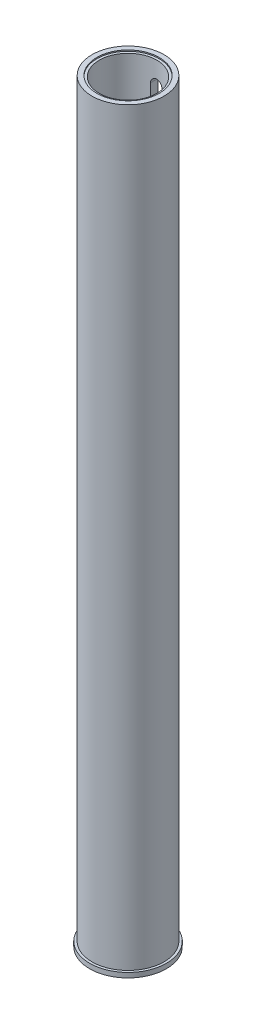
ISO-10303-21;
HEADER;
FILE_DESCRIPTION(('STEP AP214'),'2;1');
FILE_NAME('part.step','',(''),(''),'','','');
FILE_SCHEMA(('AUTOMOTIVE_DESIGN { 1 0 10303 214 1 1 1 1 }'));
ENDSEC;
DATA;
#1=APPLICATION_CONTEXT('core data for automotive mechanical design processes');
#2=APPLICATION_PROTOCOL_DEFINITION('international standard','automotive_design',2000,#1);
#3=PRODUCT_CONTEXT('',#1,'mechanical');
#4=PRODUCT('Part','Part','',(#3));
#5=PRODUCT_RELATED_PRODUCT_CATEGORY('part','',(#4));
#6=PRODUCT_DEFINITION_FORMATION('','',#4);
#7=PRODUCT_DEFINITION_CONTEXT('part definition',#1,'design');
#8=PRODUCT_DEFINITION('design','',#6,#7);
#9=PRODUCT_DEFINITION_SHAPE('','',#8);
#10=(LENGTH_UNIT() NAMED_UNIT(*) SI_UNIT(.MILLI.,.METRE.));
#11=(NAMED_UNIT(*) PLANE_ANGLE_UNIT() SI_UNIT($,.RADIAN.));
#12=(NAMED_UNIT(*) SI_UNIT($,.STERADIAN.) SOLID_ANGLE_UNIT());
#13=UNCERTAINTY_MEASURE_WITH_UNIT(LENGTH_MEASURE(1.E-05),#10,'distance_accuracy_value','');
#14=(GEOMETRIC_REPRESENTATION_CONTEXT(3) GLOBAL_UNCERTAINTY_ASSIGNED_CONTEXT((#13)) GLOBAL_UNIT_ASSIGNED_CONTEXT((#10,
#11,#12)) REPRESENTATION_CONTEXT('',''));
#15=CARTESIAN_POINT('',(0.,0.,0.));
#16=DIRECTION('',(0.,0.,1.));
#17=DIRECTION('',(1.,0.,0.));
#18=AXIS2_PLACEMENT_3D('',#15,#16,#17);
#19=CARTESIAN_POINT('',(0.,496.0874,0.));
#20=DIRECTION('',(0.,-1.,0.));
#21=DIRECTION('',(0.,0.,-1.));
#22=AXIS2_PLACEMENT_3D('',#19,#20,#21);
#23=CYLINDRICAL_SURFACE('',#22,23.8125);
#24=DIRECTION('',(0.,-1.,0.));
#25=VECTOR('',#24,1.);
#26=CARTESIAN_POINT('',(3.80999999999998,496.0874,-23.5057239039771));
#27=LINE('',#26,#25);
#28=CARTESIAN_POINT('',(3.80999999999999,480.5934,-23.5057239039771));
#29=VERTEX_POINT('',#28);
#30=CARTESIAN_POINT('',(3.81000000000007,290.83,-23.5057239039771));
#31=VERTEX_POINT('',#30);
#32=EDGE_CURVE('E132',#29,#31,#27,.T.);
#33=ORIENTED_EDGE('',*,*,#32,.F.);
#34=CARTESIAN_POINT('',(-3.80999999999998,480.5934,-23.5057239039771));
#35=CARTESIAN_POINT('',(-3.81001106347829,480.699828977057,-23.5057166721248));
#36=CARTESIAN_POINT('',(-3.80554059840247,480.806252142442,-23.5064465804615));
#37=CARTESIAN_POINT('',(-3.78772235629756,481.018323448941,-23.5093271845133));
#38=CARTESIAN_POINT('',(-3.77437543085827,481.123971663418,-23.5114777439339));
#39=CARTESIAN_POINT('',(-3.73891174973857,481.333621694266,-23.5171426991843));
#40=CARTESIAN_POINT('',(-3.71680577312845,481.437625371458,-23.5206554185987));
#41=CARTESIAN_POINT('',(-3.66401383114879,481.643350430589,-23.5289367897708));
#42=CARTESIAN_POINT('',(-3.63332788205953,481.745071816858,-23.5337054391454));
#43=CARTESIAN_POINT('',(-3.52868455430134,482.045788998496,-23.5497048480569));
#44=CARTESIAN_POINT('',(-3.4421182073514,482.240475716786,-23.5626330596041));
#45=CARTESIAN_POINT('',(-3.23799240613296,482.612456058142,-23.5915475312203));
#46=CARTESIAN_POINT('',(-3.12043305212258,482.78974973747,-23.6075337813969));
#47=CARTESIAN_POINT('',(-2.85650155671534,483.123640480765,-23.6409252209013));
#48=CARTESIAN_POINT('',(-2.70990569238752,483.28005997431,-23.6583407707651));
#49=CARTESIAN_POINT('',(-2.39253784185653,483.566198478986,-23.6925377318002));
#50=CARTESIAN_POINT('',(-2.22176216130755,483.695913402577,-23.7093190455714));
#51=CARTESIAN_POINT('',(-1.85973197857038,483.925621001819,-23.7404652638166));
#52=CARTESIAN_POINT('',(-1.66837059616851,484.025447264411,-23.754816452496));
#53=CARTESIAN_POINT('',(-1.27133941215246,484.191466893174,-23.7793684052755));
#54=CARTESIAN_POINT('',(-1.06567129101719,484.257664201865,-23.7895696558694));
#55=CARTESIAN_POINT('',(-0.647710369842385,484.354007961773,-23.8045996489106));
#56=CARTESIAN_POINT('',(-0.435488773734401,484.384456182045,-23.8094733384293));
#57=CARTESIAN_POINT('',(-0.00889157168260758,484.409375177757,-23.8134533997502));
#58=CARTESIAN_POINT('',(0.205483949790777,484.403847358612,-23.8125599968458));
#59=CARTESIAN_POINT('',(0.628231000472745,484.35720660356,-23.805142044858));
#60=CARTESIAN_POINT('',(0.836639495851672,484.316419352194,-23.7986690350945));
#61=CARTESIAN_POINT('',(1.24361452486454,484.200929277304,-23.780876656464));
#62=CARTESIAN_POINT('',(1.44218083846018,484.126225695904,-23.7695571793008));
#63=CARTESIAN_POINT('',(1.82481432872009,483.944696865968,-23.743255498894));
#64=CARTESIAN_POINT('',(2.00881588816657,483.837735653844,-23.7282578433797));
#65=CARTESIAN_POINT('',(2.3563771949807,483.594822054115,-23.6962686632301));
#66=CARTESIAN_POINT('',(2.5199361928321,483.458868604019,-23.6792770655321));
#67=CARTESIAN_POINT('',(2.82386592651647,483.160075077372,-23.6449705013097));
#68=CARTESIAN_POINT('',(2.96396011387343,482.996954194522,-23.6276540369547));
#69=CARTESIAN_POINT('',(3.21491020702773,482.649213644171,-23.5948214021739));
#70=CARTESIAN_POINT('',(3.32575772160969,482.464587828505,-23.5793057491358));
#71=CARTESIAN_POINT('',(3.46764419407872,482.17553491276,-23.5587110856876));
#72=CARTESIAN_POINT('',(3.51091641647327,482.077027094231,-23.5522859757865));
#73=CARTESIAN_POINT('',(3.58899422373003,481.876660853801,-23.5405148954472));
#74=CARTESIAN_POINT('',(3.62380307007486,481.774803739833,-23.5351685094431));
#75=CARTESIAN_POINT('',(3.68465561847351,481.568574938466,-23.5257181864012));
#76=CARTESIAN_POINT('',(3.71070857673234,481.464206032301,-23.5216129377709));
#77=CARTESIAN_POINT('',(3.75389522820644,481.253636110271,-23.514759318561));
#78=CARTESIAN_POINT('',(3.77103320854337,481.147436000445,-23.5120102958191));
#79=CARTESIAN_POINT('',(3.79243150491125,480.966439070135,-23.5085664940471));
#80=CARTESIAN_POINT('',(3.7990232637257,480.891916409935,-23.5075012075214));
#81=CARTESIAN_POINT('',(3.80780473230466,480.742731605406,-23.5060797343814));
#82=CARTESIAN_POINT('',(3.81000184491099,480.668069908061,-23.5057223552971));
#83=CARTESIAN_POINT('',(3.80999999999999,480.5934,-23.5057239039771));
#84=B_SPLINE_CURVE_WITH_KNOTS('',3,(#34,#35,#36,#37,#38,#39,#40,#41,#42,#43,#44,#45,#46,#47,#48,
#49,#50,#51,#52,#53,#54,#55,#56,#57,#58,#59,#60,#61,#62,#63,#64,#65,#66,#67,#68,#69,#70,#71,#72,
#73,#74,#75,#76,#77,#78,#79,#80,#81,#82,#83),.UNSPECIFIED.,.F.,.F.,(4,2,2,2,2,2,2,2,2,2,2,2,2,2,
2,2,2,2,2,2,2,2,2,2,4),(0.,0.319180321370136,0.638330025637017,0.957088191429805,
1.27584575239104,1.91294632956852,2.55004484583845,3.19225776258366,3.83456890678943,
4.48039248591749,5.12614033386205,5.7663971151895,6.40662888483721,7.04100938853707,
7.67540406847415,8.31251096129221,8.94964120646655,9.59381999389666,10.2381834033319,
10.5612174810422,10.8841268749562,11.2066938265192,11.5291055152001,11.7534440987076,
11.9774044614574),.UNSPECIFIED.);
#85=CARTESIAN_POINT('',(-3.80999999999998,480.5934,-23.5057239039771));
#86=VERTEX_POINT('',#85);
#87=EDGE_CURVE('E126',#86,#29,#84,.T.);
#88=ORIENTED_EDGE('',*,*,#87,.F.);
#89=DIRECTION('',(0.,-1.,0.));
#90=VECTOR('',#89,1.);
#91=CARTESIAN_POINT('',(-3.80999999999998,496.0874,-23.5057239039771));
#92=LINE('',#91,#90);
#93=CARTESIAN_POINT('',(-3.80999999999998,290.83,-23.5057239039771));
#94=VERTEX_POINT('',#93);
#95=EDGE_CURVE('E86',#94,#86,#92,.F.);
#96=ORIENTED_EDGE('',*,*,#95,.F.);
#97=CARTESIAN_POINT('',(3.81000000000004,290.83,-23.5057239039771));
#98=CARTESIAN_POINT('',(3.81001106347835,290.723571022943,-23.5057166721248));
#99=CARTESIAN_POINT('',(3.80554059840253,290.617147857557,-23.5064465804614));
#100=CARTESIAN_POINT('',(3.78772235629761,290.405076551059,-23.5093271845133));
#101=CARTESIAN_POINT('',(3.77437543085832,290.299428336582,-23.5114777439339));
#102=CARTESIAN_POINT('',(3.73891174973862,290.089778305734,-23.5171426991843));
#103=CARTESIAN_POINT('',(3.7168057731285,289.985774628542,-23.5206554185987));
#104=CARTESIAN_POINT('',(3.66401383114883,289.780049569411,-23.5289367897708));
#105=CARTESIAN_POINT('',(3.63332788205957,289.678328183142,-23.5337054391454));
#106=CARTESIAN_POINT('',(3.52868455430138,289.377611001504,-23.5497048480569));
#107=CARTESIAN_POINT('',(3.44211820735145,289.182924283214,-23.5626330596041));
#108=CARTESIAN_POINT('',(3.23799240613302,288.810943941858,-23.5915475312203));
#109=CARTESIAN_POINT('',(3.12043305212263,288.63365026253,-23.6075337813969));
#110=CARTESIAN_POINT('',(2.85650155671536,288.299759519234,-23.6409252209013));
#111=CARTESIAN_POINT('',(2.70990569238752,288.143340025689,-23.6583407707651));
#112=CARTESIAN_POINT('',(2.39253784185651,287.857201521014,-23.6925377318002));
#113=CARTESIAN_POINT('',(2.22176216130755,287.727486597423,-23.7093190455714));
#114=CARTESIAN_POINT('',(1.85973197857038,287.497778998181,-23.7404652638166));
#115=CARTESIAN_POINT('',(1.66837059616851,287.397952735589,-23.754816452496));
#116=CARTESIAN_POINT('',(1.27133941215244,287.231933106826,-23.7793684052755));
#117=CARTESIAN_POINT('',(1.06567129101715,287.165735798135,-23.7895696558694));
#118=CARTESIAN_POINT('',(0.64771036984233,287.069392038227,-23.8045996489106));
#119=CARTESIAN_POINT('',(0.435488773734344,287.038943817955,-23.8094733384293));
#120=CARTESIAN_POINT('',(0.00889157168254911,287.014024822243,-23.8134533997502));
#121=CARTESIAN_POINT('',(-0.205483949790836,287.019552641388,-23.8125599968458));
#122=CARTESIAN_POINT('',(-0.628231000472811,287.06619339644,-23.805142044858));
#123=CARTESIAN_POINT('',(-0.836639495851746,287.106980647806,-23.7986690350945));
#124=CARTESIAN_POINT('',(-1.24361452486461,287.222470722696,-23.780876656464));
#125=CARTESIAN_POINT('',(-1.44218083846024,287.297174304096,-23.7695571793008));
#126=CARTESIAN_POINT('',(-1.82481432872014,287.478703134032,-23.743255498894));
#127=CARTESIAN_POINT('',(-2.00881588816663,287.585664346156,-23.7282578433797));
#128=CARTESIAN_POINT('',(-2.35637719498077,287.828577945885,-23.6962686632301));
#129=CARTESIAN_POINT('',(-2.51993619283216,287.964531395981,-23.6792770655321));
#130=CARTESIAN_POINT('',(-2.82386592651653,288.263324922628,-23.6449705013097));
#131=CARTESIAN_POINT('',(-2.9639601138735,288.426445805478,-23.6276540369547));
#132=CARTESIAN_POINT('',(-3.2149102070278,288.774186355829,-23.5948214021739));
#133=CARTESIAN_POINT('',(-3.32575772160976,288.958812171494,-23.5793057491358));
#134=CARTESIAN_POINT('',(-3.4676441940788,289.24786508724,-23.5587110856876));
#135=CARTESIAN_POINT('',(-3.51091641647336,289.346372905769,-23.5522859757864));
#136=CARTESIAN_POINT('',(-3.58899422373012,289.546739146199,-23.5405148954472));
#137=CARTESIAN_POINT('',(-3.62380307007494,289.648596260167,-23.5351685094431));
#138=CARTESIAN_POINT('',(-3.68465561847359,289.854825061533,-23.5257181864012));
#139=CARTESIAN_POINT('',(-3.71070857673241,289.959193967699,-23.5216129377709));
#140=CARTESIAN_POINT('',(-3.7538952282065,290.169763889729,-23.514759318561));
#141=CARTESIAN_POINT('',(-3.77103320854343,290.275963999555,-23.5120102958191));
#142=CARTESIAN_POINT('',(-3.7924315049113,290.456960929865,-23.5085664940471));
#143=CARTESIAN_POINT('',(-3.79902326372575,290.531483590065,-23.5075012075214));
#144=CARTESIAN_POINT('',(-3.8078047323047,290.680668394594,-23.5060797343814));
#145=CARTESIAN_POINT('',(-3.81000184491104,290.755330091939,-23.5057223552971));
#146=CARTESIAN_POINT('',(-3.81000000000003,290.83,-23.5057239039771));
#147=B_SPLINE_CURVE_WITH_KNOTS('',3,(#97,#98,#99,#100,#101,#102,#103,#104,#105,#106,#107,#108,
#109,#110,#111,#112,#113,#114,#115,#116,#117,#118,#119,#120,#121,#122,#123,#124,#125,#126,#127,
#128,#129,#130,#131,#132,#133,#134,#135,#136,#137,#138,#139,#140,#141,#142,#143,#144,#145,#146),
.UNSPECIFIED.,.F.,.F.,(4,2,2,2,2,2,2,2,2,2,2,2,2,2,2,2,2,2,2,2,2,2,2,2,4),(0.,0.319180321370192,
0.638330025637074,0.957088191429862,1.2758457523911,1.91294632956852,2.55004484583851,
3.19225776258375,3.83456890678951,4.48039248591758,5.12614033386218,5.76639711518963,
6.40662888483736,7.04100938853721,7.6754040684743,8.31251096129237,8.94964120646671,
9.59381999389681,10.2381834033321,10.5612174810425,10.8841268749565,11.2066938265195,
11.5291055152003,11.7534440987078,11.9774044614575),.UNSPECIFIED.);
#148=EDGE_CURVE('E46',#31,#94,#147,.T.);
#149=ORIENTED_EDGE('',*,*,#148,.F.);
#150=EDGE_LOOP('',(#33,#88,#96,#149));
#151=FACE_BOUND('',#150,.T.);
#152=CARTESIAN_POINT('',(0.,496.0874,0.));
#153=DIRECTION('',(0.,1.,0.));
#154=DIRECTION('',(0.,0.,1.));
#155=AXIS2_PLACEMENT_3D('',#152,#153,#154);
#156=CIRCLE('',#155,23.8125);
#157=CARTESIAN_POINT('',(0.,496.0874,23.8125));
#158=VERTEX_POINT('',#157);
#159=EDGE_CURVE('E153',#158,#158,#156,.T.);
#160=ORIENTED_EDGE('',*,*,#159,.F.);
#161=EDGE_LOOP('',(#160));
#162=FACE_BOUND('',#161,.T.);
#163=CARTESIAN_POINT('',(0.,0.,0.));
#164=DIRECTION('',(0.,1.,0.));
#165=DIRECTION('',(0.,0.,1.));
#166=AXIS2_PLACEMENT_3D('',#163,#164,#165);
#167=CIRCLE('',#166,23.8125);
#168=CARTESIAN_POINT('',(0.,0.,23.8125));
#169=VERTEX_POINT('',#168);
#170=EDGE_CURVE('E146',#169,#169,#167,.T.);
#171=ORIENTED_EDGE('',*,*,#170,.T.);
#172=EDGE_LOOP('',(#171));
#173=FACE_BOUND('',#172,.T.);
#174=ADVANCED_FACE('F32',(#151,#162,#173),#23,.T.);
#175=CARTESIAN_POINT('',(0.,496.0874,0.));
#176=DIRECTION('',(0.,1.,0.));
#177=DIRECTION('',(0.,0.,1.));
#178=AXIS2_PLACEMENT_3D('',#175,#176,#177);
#179=PLANE('',#178);
#180=CARTESIAN_POINT('',(0.,496.0874,0.));
#181=DIRECTION('',(0.,1.,0.));
#182=DIRECTION('',(0.,0.,1.));
#183=AXIS2_PLACEMENT_3D('',#180,#181,#182);
#184=CIRCLE('',#183,20.6375);
#185=CARTESIAN_POINT('',(0.,496.0874,20.6375));
#186=VERTEX_POINT('',#185);
#187=EDGE_CURVE('E147',#186,#186,#184,.T.);
#188=ORIENTED_EDGE('',*,*,#187,.F.);
#189=EDGE_LOOP('',(#188));
#190=FACE_BOUND('',#189,.T.);
#191=ORIENTED_EDGE('',*,*,#159,.T.);
#192=EDGE_LOOP('',(#191));
#193=FACE_BOUND('',#192,.T.);
#194=ADVANCED_FACE('F169',(#190,#193),#179,.T.);
#195=CARTESIAN_POINT('',(0.,495.3,0.));
#196=DIRECTION('',(0.,1.,0.));
#197=DIRECTION('',(0.,0.,1.));
#198=AXIS2_PLACEMENT_3D('',#195,#196,#197);
#199=CYLINDRICAL_SURFACE('',#198,20.6375);
#200=CARTESIAN_POINT('',(0.,495.3,0.));
#201=DIRECTION('',(0.,1.,0.));
#202=DIRECTION('',(0.,0.,1.));
#203=AXIS2_PLACEMENT_3D('',#200,#201,#202);
#204=CIRCLE('',#203,20.6375);
#205=CARTESIAN_POINT('',(0.,495.3,20.6375));
#206=VERTEX_POINT('',#205);
#207=EDGE_CURVE('E150',#206,#206,#204,.T.);
#208=ORIENTED_EDGE('',*,*,#207,.F.);
#209=EDGE_LOOP('',(#208));
#210=FACE_BOUND('',#209,.T.);
#211=ORIENTED_EDGE('',*,*,#187,.T.);
#212=EDGE_LOOP('',(#211));
#213=FACE_BOUND('',#212,.T.);
#214=ADVANCED_FACE('F174',(#210,#213),#199,.F.);
#215=CARTESIAN_POINT('',(0.,495.3,0.));
#216=DIRECTION('',(0.,1.,0.));
#217=DIRECTION('',(0.,0.,1.));
#218=AXIS2_PLACEMENT_3D('',#215,#216,#217);
#219=PLANE('',#218);
#220=CARTESIAN_POINT('',(0.,495.3,0.));
#221=DIRECTION('',(0.,1.,0.));
#222=DIRECTION('',(0.,0.,1.));
#223=AXIS2_PLACEMENT_3D('',#220,#221,#222);
#224=CIRCLE('',#223,19.05);
#225=CARTESIAN_POINT('',(0.,495.3,19.05));
#226=VERTEX_POINT('',#225);
#227=EDGE_CURVE('E137',#226,#226,#224,.T.);
#228=ORIENTED_EDGE('',*,*,#227,.F.);
#229=EDGE_LOOP('',(#228));
#230=FACE_BOUND('',#229,.T.);
#231=ORIENTED_EDGE('',*,*,#207,.T.);
#232=EDGE_LOOP('',(#231));
#233=FACE_BOUND('',#232,.T.);
#234=ADVANCED_FACE('F192',(#230,#233),#219,.T.);
#235=CARTESIAN_POINT('',(0.,-3.175,0.));
#236=DIRECTION('',(0.,1.,0.));
#237=DIRECTION('',(0.,0.,1.));
#238=AXIS2_PLACEMENT_3D('',#235,#236,#237);
#239=CYLINDRICAL_SURFACE('',#238,25.4);
#240=CARTESIAN_POINT('',(0.,-3.175,0.));
#241=DIRECTION('',(0.,-1.,0.));
#242=DIRECTION('',(0.,0.,-1.));
#243=AXIS2_PLACEMENT_3D('',#240,#241,#242);
#244=CIRCLE('',#243,25.4);
#245=CARTESIAN_POINT('',(0.,-3.175,-25.4));
#246=VERTEX_POINT('',#245);
#247=EDGE_CURVE('E143',#246,#246,#244,.T.);
#248=ORIENTED_EDGE('',*,*,#247,.F.);
#249=EDGE_LOOP('',(#248));
#250=FACE_BOUND('',#249,.T.);
#251=CARTESIAN_POINT('',(0.,0.,0.));
#252=DIRECTION('',(0.,-1.,0.));
#253=DIRECTION('',(0.,0.,-1.));
#254=AXIS2_PLACEMENT_3D('',#251,#252,#253);
#255=CIRCLE('',#254,25.4);
#256=CARTESIAN_POINT('',(0.,0.,-25.4));
#257=VERTEX_POINT('',#256);
#258=EDGE_CURVE('E140',#257,#257,#255,.T.);
#259=ORIENTED_EDGE('',*,*,#258,.T.);
#260=EDGE_LOOP('',(#259));
#261=FACE_BOUND('',#260,.T.);
#262=ADVANCED_FACE('F190',(#250,#261),#239,.T.);
#263=CARTESIAN_POINT('',(0.,-3.175,0.));
#264=DIRECTION('',(0.,-1.,0.));
#265=DIRECTION('',(0.,0.,-1.));
#266=AXIS2_PLACEMENT_3D('',#263,#264,#265);
#267=PLANE('',#266);
#268=CARTESIAN_POINT('',(0.,-3.175,0.));
#269=DIRECTION('',(0.,-1.,0.));
#270=DIRECTION('',(0.,0.,-1.));
#271=AXIS2_PLACEMENT_3D('',#268,#269,#270);
#272=CIRCLE('',#271,20.4216);
#273=CARTESIAN_POINT('',(0.,-3.175,-20.4216));
#274=VERTEX_POINT('',#273);
#275=EDGE_CURVE('E11',#274,#274,#272,.F.);
#276=ORIENTED_EDGE('',*,*,#275,.T.);
#277=EDGE_LOOP('',(#276));
#278=FACE_BOUND('',#277,.T.);
#279=ORIENTED_EDGE('',*,*,#247,.T.);
#280=EDGE_LOOP('',(#279));
#281=FACE_BOUND('',#280,.T.);
#282=ADVANCED_FACE('F186',(#278,#281),#267,.T.);
#283=CARTESIAN_POINT('',(0.,0.,0.));
#284=DIRECTION('',(0.,-1.,0.));
#285=DIRECTION('',(0.,0.,-1.));
#286=AXIS2_PLACEMENT_3D('',#283,#284,#285);
#287=PLANE('',#286);
#288=ORIENTED_EDGE('',*,*,#170,.F.);
#289=EDGE_LOOP('',(#288));
#290=FACE_BOUND('',#289,.T.);
#291=ORIENTED_EDGE('',*,*,#258,.F.);
#292=EDGE_LOOP('',(#291));
#293=FACE_BOUND('',#292,.T.);
#294=ADVANCED_FACE('F166',(#290,#293),#287,.F.);
#295=CARTESIAN_POINT('',(0.,496.0874,0.));
#296=DIRECTION('',(0.,-1.,0.));
#297=DIRECTION('',(0.,0.,-1.));
#298=AXIS2_PLACEMENT_3D('',#295,#296,#297);
#299=CYLINDRICAL_SURFACE('',#298,19.05);
#300=DIRECTION('',(0.,-1.,0.));
#301=VECTOR('',#300,1.);
#302=CARTESIAN_POINT('',(-3.80999999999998,496.0874,-18.6651118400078));
#303=LINE('',#302,#301);
#304=CARTESIAN_POINT('',(-3.80999999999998,480.5934,-18.6651118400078));
#305=VERTEX_POINT('',#304);
#306=CARTESIAN_POINT('',(-3.80999999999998,290.83,-18.6651118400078));
#307=VERTEX_POINT('',#306);
#308=EDGE_CURVE('E83',#305,#307,#303,.T.);
#309=ORIENTED_EDGE('',*,*,#308,.F.);
#310=CARTESIAN_POINT('',(3.80999999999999,480.5934,-18.6651118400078));
#311=CARTESIAN_POINT('',(3.81001151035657,480.699415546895,-18.6651026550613));
#312=CARTESIAN_POINT('',(3.80557521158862,480.805424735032,-18.6660148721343));
#313=CARTESIAN_POINT('',(3.78789627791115,481.016663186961,-18.6696141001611));
#314=CARTESIAN_POINT('',(3.77465473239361,481.121892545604,-18.6723008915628));
#315=CARTESIAN_POINT('',(3.73948129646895,481.330671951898,-18.679375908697));
#316=CARTESIAN_POINT('',(3.7175626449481,481.434224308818,-18.6837615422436));
#317=CARTESIAN_POINT('',(3.66522916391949,481.639049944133,-18.6940980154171));
#318=CARTESIAN_POINT('',(3.63481429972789,481.740323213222,-18.7000488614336));
#319=CARTESIAN_POINT('',(3.53112740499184,482.039683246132,-18.7200071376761));
#320=CARTESIAN_POINT('',(3.44538500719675,482.233475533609,-18.7361263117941));
#321=CARTESIAN_POINT('',(3.24326967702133,482.603844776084,-18.7721647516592));
#322=CARTESIAN_POINT('',(3.12689356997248,482.780419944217,-18.7920844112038));
#323=CARTESIAN_POINT('',(2.86504804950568,483.113931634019,-18.8337928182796));
#324=CARTESIAN_POINT('',(2.71923153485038,483.27059359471,-18.8556019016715));
#325=CARTESIAN_POINT('',(2.40338773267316,483.55740945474,-18.8984544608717));
#326=CARTESIAN_POINT('',(2.23335670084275,483.687559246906,-18.9194978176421));
#327=CARTESIAN_POINT('',(1.87208197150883,483.918724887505,-18.958667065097));
#328=CARTESIAN_POINT('',(1.68066657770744,484.019477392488,-18.9767659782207));
#329=CARTESIAN_POINT('',(1.28321253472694,484.187281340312,-19.0077758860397));
#330=CARTESIAN_POINT('',(1.07717605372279,484.254337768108,-19.0206876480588));
#331=CARTESIAN_POINT('',(0.659196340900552,484.351991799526,-19.039725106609));
#332=CARTESIAN_POINT('',(0.447366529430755,484.383057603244,-19.0459378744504));
#333=CARTESIAN_POINT('',(0.0214117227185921,484.40930923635,-19.0511781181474));
#334=CARTESIAN_POINT('',(-0.192713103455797,484.404497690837,-19.0502061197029));
#335=CARTESIAN_POINT('',(-0.613951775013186,484.359485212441,-19.0412535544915));
#336=CARTESIAN_POINT('',(-0.821122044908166,484.319789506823,-19.0333730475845));
#337=CARTESIAN_POINT('',(-1.22579900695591,484.206936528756,-19.0116018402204));
#338=CARTESIAN_POINT('',(-1.42330538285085,484.133778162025,-18.9977109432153));
#339=CARTESIAN_POINT('',(-1.80449300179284,483.955609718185,-18.9653147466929));
#340=CARTESIAN_POINT('',(-1.98807895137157,483.850401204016,-18.9467808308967));
#341=CARTESIAN_POINT('',(-2.33517439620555,483.611259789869,-18.9071420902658));
#342=CARTESIAN_POINT('',(-2.49868222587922,483.477324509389,-18.8860370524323));
#343=CARTESIAN_POINT('',(-2.80395175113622,483.181813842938,-18.843156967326));
#344=CARTESIAN_POINT('',(-2.94528788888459,483.019800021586,-18.8213766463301));
#345=CARTESIAN_POINT('',(-3.19892993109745,482.673993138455,-18.7799343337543));
#346=CARTESIAN_POINT('',(-3.3112277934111,482.490194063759,-18.760272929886));
#347=CARTESIAN_POINT('',(-3.45546062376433,482.201982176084,-18.7340510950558));
#348=CARTESIAN_POINT('',(-3.4995629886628,482.103627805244,-18.7258431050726));
#349=CARTESIAN_POINT('',(-3.57930549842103,481.903459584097,-18.7107649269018));
#350=CARTESIAN_POINT('',(-3.61494894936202,481.801647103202,-18.7038942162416));
#351=CARTESIAN_POINT('',(-3.67745934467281,481.595397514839,-18.691704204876));
#352=CARTESIAN_POINT('',(-3.70433543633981,481.490963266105,-18.686383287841));
#353=CARTESIAN_POINT('',(-3.74914106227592,481.280162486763,-18.6774453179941));
#354=CARTESIAN_POINT('',(-3.76707485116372,481.173796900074,-18.6738274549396));
#355=CARTESIAN_POINT('',(-3.79030658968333,480.988299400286,-18.6691236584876));
#356=CARTESIAN_POINT('',(-3.79769503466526,480.909433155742,-18.6676205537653));
#357=CARTESIAN_POINT('',(-3.80753900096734,480.751513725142,-18.6656141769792));
#358=CARTESIAN_POINT('',(-3.81000277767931,480.672461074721,-18.665109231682));
#359=CARTESIAN_POINT('',(-3.80999999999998,480.5934,-18.6651118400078));
#360=B_SPLINE_CURVE_WITH_KNOTS('',3,(#310,#311,#312,#313,#314,#315,#316,#317,#318,#319,#320,
#321,#322,#323,#324,#325,#326,#327,#328,#329,#330,#331,#332,#333,#334,#335,#336,#337,#338,#339,
#340,#341,#342,#343,#344,#345,#346,#347,#348,#349,#350,#351,#352,#353,#354,#355,#356,#357,#358,
#359),.UNSPECIFIED.,.F.,.F.,(4,2,2,2,2,2,2,2,2,2,2,2,2,2,2,2,2,2,2,2,2,2,2,2,4),(0.,
0.317938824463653,0.635838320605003,0.953254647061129,1.27067226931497,1.90501053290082,
2.53941456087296,3.18178786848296,3.82426061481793,4.47232342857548,5.12029034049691,
5.75972972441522,6.39912232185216,7.02940444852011,7.65970718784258,8.29399458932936,
8.92833457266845,9.57365820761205,10.2191603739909,10.5431408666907,10.8669945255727,
11.1905092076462,11.5138698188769,11.7513950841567,11.9885218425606),.UNSPECIFIED.);
#361=CARTESIAN_POINT('',(3.80999999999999,480.5934,-18.6651118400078));
#362=VERTEX_POINT('',#361);
#363=EDGE_CURVE('E54',#362,#305,#360,.T.);
#364=ORIENTED_EDGE('',*,*,#363,.F.);
#365=DIRECTION('',(0.,-1.,0.));
#366=VECTOR('',#365,1.);
#367=CARTESIAN_POINT('',(3.80999999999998,496.0874,-18.6651118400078));
#368=LINE('',#367,#366);
#369=CARTESIAN_POINT('',(3.81000000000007,290.83,-18.6651118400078));
#370=VERTEX_POINT('',#369);
#371=EDGE_CURVE('E92',#370,#362,#368,.F.);
#372=ORIENTED_EDGE('',*,*,#371,.F.);
#373=CARTESIAN_POINT('',(-3.81000000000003,290.83,-18.6651118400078));
#374=CARTESIAN_POINT('',(-3.81001151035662,290.723984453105,-18.6651026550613));
#375=CARTESIAN_POINT('',(-3.80557521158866,290.617975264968,-18.6660148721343));
#376=CARTESIAN_POINT('',(-3.78789627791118,290.406736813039,-18.669614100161));
#377=CARTESIAN_POINT('',(-3.77465473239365,290.301507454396,-18.6723008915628));
#378=CARTESIAN_POINT('',(-3.73948129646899,290.092728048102,-18.679375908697));
#379=CARTESIAN_POINT('',(-3.71756264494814,289.989175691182,-18.6837615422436));
#380=CARTESIAN_POINT('',(-3.66522916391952,289.784350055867,-18.6940980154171));
#381=CARTESIAN_POINT('',(-3.63481429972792,289.683076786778,-18.7000488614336));
#382=CARTESIAN_POINT('',(-3.53112740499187,289.383716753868,-18.7200071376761));
#383=CARTESIAN_POINT('',(-3.44538500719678,289.189924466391,-18.7361263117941));
#384=CARTESIAN_POINT('',(-3.24326967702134,288.819555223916,-18.7721647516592));
#385=CARTESIAN_POINT('',(-3.12689356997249,288.642980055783,-18.7920844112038));
#386=CARTESIAN_POINT('',(-2.86504804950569,288.30946836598,-18.8337928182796));
#387=CARTESIAN_POINT('',(-2.71923153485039,288.15280640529,-18.8556019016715));
#388=CARTESIAN_POINT('',(-2.40338773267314,287.865990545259,-18.8984544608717));
#389=CARTESIAN_POINT('',(-2.2333567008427,287.735840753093,-18.9194978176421));
#390=CARTESIAN_POINT('',(-1.87208197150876,287.504675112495,-18.958667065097));
#391=CARTESIAN_POINT('',(-1.68066657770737,287.403922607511,-18.9767659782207));
#392=CARTESIAN_POINT('',(-1.28321253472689,287.236118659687,-19.0077758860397));
#393=CARTESIAN_POINT('',(-1.07717605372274,287.169062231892,-19.0206876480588));
#394=CARTESIAN_POINT('',(-0.659196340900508,287.071408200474,-19.039725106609));
#395=CARTESIAN_POINT('',(-0.447366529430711,287.040342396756,-19.0459378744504));
#396=CARTESIAN_POINT('',(-0.0214117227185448,287.01409076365,-19.0511781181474));
#397=CARTESIAN_POINT('',(0.192713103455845,287.018902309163,-19.0502061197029));
#398=CARTESIAN_POINT('',(0.613951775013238,287.063914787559,-19.0412535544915));
#399=CARTESIAN_POINT('',(0.821122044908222,287.103610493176,-19.0333730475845));
#400=CARTESIAN_POINT('',(1.22579900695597,287.216463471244,-19.0116018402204));
#401=CARTESIAN_POINT('',(1.42330538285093,287.289621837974,-18.9977109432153));
#402=CARTESIAN_POINT('',(1.80449300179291,287.467790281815,-18.9653147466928));
#403=CARTESIAN_POINT('',(1.98807895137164,287.572998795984,-18.9467808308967));
#404=CARTESIAN_POINT('',(2.33517439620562,287.812140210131,-18.9071420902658));
#405=CARTESIAN_POINT('',(2.4986822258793,287.946075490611,-18.8860370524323));
#406=CARTESIAN_POINT('',(2.8039517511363,288.241586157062,-18.843156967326));
#407=CARTESIAN_POINT('',(2.94528788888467,288.403599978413,-18.8213766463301));
#408=CARTESIAN_POINT('',(3.19892993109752,288.749406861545,-18.7799343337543));
#409=CARTESIAN_POINT('',(3.31122779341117,288.933205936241,-18.760272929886));
#410=CARTESIAN_POINT('',(3.45546062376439,289.221417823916,-18.7340510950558));
#411=CARTESIAN_POINT('',(3.49956298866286,289.319772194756,-18.7258431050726));
#412=CARTESIAN_POINT('',(3.57930549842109,289.519940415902,-18.7107649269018));
#413=CARTESIAN_POINT('',(3.61494894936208,289.621752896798,-18.7038942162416));
#414=CARTESIAN_POINT('',(3.67745934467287,289.828002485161,-18.691704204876));
#415=CARTESIAN_POINT('',(3.70433543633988,289.932436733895,-18.686383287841));
#416=CARTESIAN_POINT('',(3.749141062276,290.143237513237,-18.6774453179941));
#417=CARTESIAN_POINT('',(3.76707485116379,290.249603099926,-18.6738274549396));
#418=CARTESIAN_POINT('',(3.79030658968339,290.435100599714,-18.6691236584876));
#419=CARTESIAN_POINT('',(3.79769503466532,290.513966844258,-18.6676205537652));
#420=CARTESIAN_POINT('',(3.80753900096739,290.671886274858,-18.6656141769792));
#421=CARTESIAN_POINT('',(3.81000277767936,290.750938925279,-18.665109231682));
#422=CARTESIAN_POINT('',(3.81000000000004,290.83,-18.6651118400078));
#423=B_SPLINE_CURVE_WITH_KNOTS('',3,(#373,#374,#375,#376,#377,#378,#379,#380,#381,#382,#383,
#384,#385,#386,#387,#388,#389,#390,#391,#392,#393,#394,#395,#396,#397,#398,#399,#400,#401,#402,
#403,#404,#405,#406,#407,#408,#409,#410,#411,#412,#413,#414,#415,#416,#417,#418,#419,#420,#421,
#422),.UNSPECIFIED.,.F.,.F.,(4,2,2,2,2,2,2,2,2,2,2,2,2,2,2,2,2,2,2,2,2,2,2,2,4),(0.,
0.317938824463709,0.635838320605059,0.953254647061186,1.27067226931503,1.90501053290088,
2.53941456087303,3.18178786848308,3.8242606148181,4.47232342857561,5.12029034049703,
5.75972972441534,6.39912232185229,7.02940444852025,7.65970718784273,8.2939945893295,
8.92833457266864,9.57365820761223,10.219160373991,10.5431408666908,10.8669945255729,
11.1905092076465,11.5138698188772,11.7513950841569,11.9885218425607),.UNSPECIFIED.);
#424=EDGE_CURVE('E74',#307,#370,#423,.T.);
#425=ORIENTED_EDGE('',*,*,#424,.F.);
#426=EDGE_LOOP('',(#309,#364,#372,#425));
#427=FACE_BOUND('',#426,.T.);
#428=CARTESIAN_POINT('',(0.,-0.799319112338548,0.));
#429=DIRECTION('',(0.,-1.,0.));
#430=DIRECTION('',(0.,0.,-1.));
#431=AXIS2_PLACEMENT_3D('',#428,#429,#430);
#432=CIRCLE('',#431,19.05);
#433=CARTESIAN_POINT('',(0.,-0.799319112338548,-19.05));
#434=VERTEX_POINT('',#433);
#435=EDGE_CURVE('E39',#434,#434,#432,.T.);
#436=ORIENTED_EDGE('',*,*,#435,.T.);
#437=EDGE_LOOP('',(#436));
#438=FACE_BOUND('',#437,.T.);
#439=ORIENTED_EDGE('',*,*,#227,.T.);
#440=EDGE_LOOP('',(#439));
#441=FACE_BOUND('',#440,.T.);
#442=ADVANCED_FACE('F89',(#427,#438,#441),#299,.F.);
#443=CARTESIAN_POINT('',(0.,-0.799319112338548,0.));
#444=DIRECTION('',(0.,-1.,0.));
#445=DIRECTION('',(0.,0.,-1.));
#446=AXIS2_PLACEMENT_3D('',#443,#444,#445);
#447=CONICAL_SURFACE('',#446,19.05,0.523598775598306);
#448=ORIENTED_EDGE('',*,*,#275,.F.);
#449=EDGE_LOOP('',(#448));
#450=FACE_BOUND('',#449,.T.);
#451=ORIENTED_EDGE('',*,*,#435,.F.);
#452=EDGE_LOOP('',(#451));
#453=FACE_BOUND('',#452,.T.);
#454=ADVANCED_FACE('F122',(#450,#453),#447,.F.);
#455=CARTESIAN_POINT('',(0.,480.5934,-25.401));
#456=DIRECTION('',(0.,0.,1.));
#457=DIRECTION('',(1.,0.,0.));
#458=AXIS2_PLACEMENT_3D('',#455,#456,#457);
#459=CYLINDRICAL_SURFACE('',#458,3.80999999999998);
#460=ORIENTED_EDGE('',*,*,#87,.T.);
#461=DIRECTION('',(0.,0.,1.));
#462=VECTOR('',#461,1.);
#463=CARTESIAN_POINT('',(3.80999999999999,480.5934,-25.401));
#464=LINE('',#463,#462);
#465=EDGE_CURVE('E87',#29,#362,#464,.T.);
#466=ORIENTED_EDGE('',*,*,#465,.T.);
#467=ORIENTED_EDGE('',*,*,#363,.T.);
#468=DIRECTION('',(0.,0.,1.));
#469=VECTOR('',#468,1.);
#470=CARTESIAN_POINT('',(-3.80999999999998,480.5934,-25.401));
#471=LINE('',#470,#469);
#472=EDGE_CURVE('E80',#86,#305,#471,.T.);
#473=ORIENTED_EDGE('',*,*,#472,.F.);
#474=EDGE_LOOP('',(#460,#466,#467,#473));
#475=FACE_BOUND('',#474,.T.);
#476=ADVANCED_FACE('F117',(#475),#459,.F.);
#477=CARTESIAN_POINT('',(3.81000000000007,290.83,-25.401));
#478=DIRECTION('',(1.,0.,0.));
#479=DIRECTION('',(0.,1.,0.));
#480=AXIS2_PLACEMENT_3D('',#477,#478,#479);
#481=PLANE('',#480);
#482=ORIENTED_EDGE('',*,*,#32,.T.);
#483=DIRECTION('',(0.,0.,1.));
#484=VECTOR('',#483,1.);
#485=CARTESIAN_POINT('',(3.81000000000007,290.83,-25.401));
#486=LINE('',#485,#484);
#487=EDGE_CURVE('E79',#31,#370,#486,.T.);
#488=ORIENTED_EDGE('',*,*,#487,.T.);
#489=ORIENTED_EDGE('',*,*,#371,.T.);
#490=ORIENTED_EDGE('',*,*,#465,.F.);
#491=EDGE_LOOP('',(#482,#488,#489,#490));
#492=FACE_BOUND('',#491,.T.);
#493=ADVANCED_FACE('F121',(#492),#481,.F.);
#494=CARTESIAN_POINT('',(0.,290.83,-25.401));
#495=DIRECTION('',(0.,0.,1.));
#496=DIRECTION('',(1.,0.,0.));
#497=AXIS2_PLACEMENT_3D('',#494,#495,#496);
#498=CYLINDRICAL_SURFACE('',#497,3.81000000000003);
#499=ORIENTED_EDGE('',*,*,#148,.T.);
#500=DIRECTION('',(0.,0.,1.));
#501=VECTOR('',#500,1.);
#502=CARTESIAN_POINT('',(-3.81000000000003,290.83,-25.401));
#503=LINE('',#502,#501);
#504=EDGE_CURVE('E70',#94,#307,#503,.T.);
#505=ORIENTED_EDGE('',*,*,#504,.T.);
#506=ORIENTED_EDGE('',*,*,#424,.T.);
#507=ORIENTED_EDGE('',*,*,#487,.F.);
#508=EDGE_LOOP('',(#499,#505,#506,#507));
#509=FACE_BOUND('',#508,.T.);
#510=ADVANCED_FACE('F72',(#509),#498,.F.);
#511=CARTESIAN_POINT('',(-3.81,290.83,-25.401));
#512=DIRECTION('',(-1.,0.,0.));
#513=DIRECTION('',(0.,-1.,0.));
#514=AXIS2_PLACEMENT_3D('',#511,#512,#513);
#515=PLANE('',#514);
#516=ORIENTED_EDGE('',*,*,#95,.T.);
#517=ORIENTED_EDGE('',*,*,#472,.T.);
#518=ORIENTED_EDGE('',*,*,#308,.T.);
#519=ORIENTED_EDGE('',*,*,#504,.F.);
#520=EDGE_LOOP('',(#516,#517,#518,#519));
#521=FACE_BOUND('',#520,.T.);
#522=ADVANCED_FACE('F84',(#521),#515,.F.);
#523=CLOSED_SHELL('',(#174,#194,#214,#234,#262,#282,#294,#442,#454,#476,#493,#510,#522));
#524=MANIFOLD_SOLID_BREP('B2',#523);
#525=ADVANCED_BREP_SHAPE_REPRESENTATION('',(#18,#524),#14);
#526=SHAPE_DEFINITION_REPRESENTATION(#9,#525);
ENDSEC;
END-ISO-10303-21;
